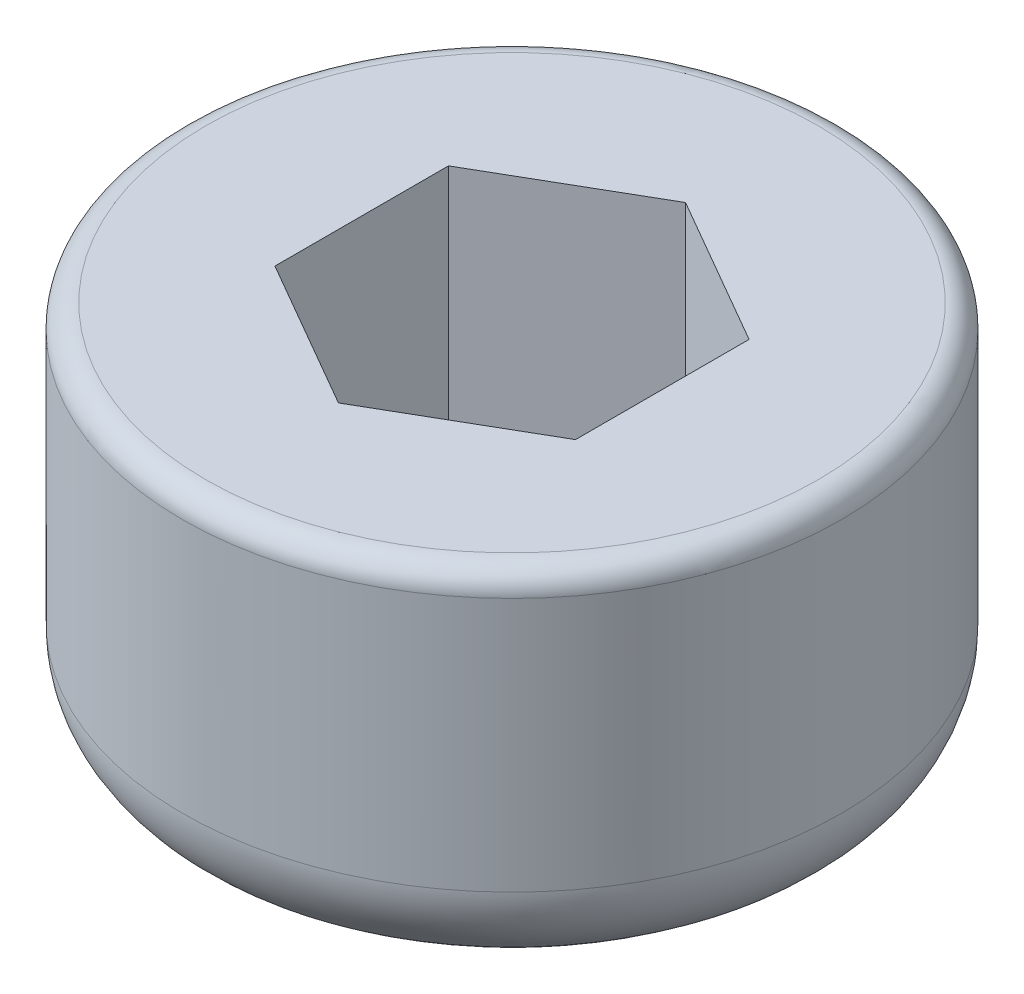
from build123d import *

# Parameters (mm, degrees)
CORTAR_EXTRUIR1_DEPTH = 26.731789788
REDONDEO1_R           = 1


with BuildPart() as part:
    # Croquis1 → Revoluci_n1 (revolve)
    with BuildSketch(Plane.XY):
        with BuildLine():
            Line((0, 0), (10.25, 0))
            ThreePointArc((10.25, 0), (13.078427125, 1.171572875), (14.25, 4))
            Line((14.25, 4), (14.25, 16))
            Line((14.25, 16), (0, 16))
            Line((0, 16), (0, 0))
        make_face()
    revolve(axis=Axis((0, 0, 0), (0, 1, 0)))

    # Croquis2 → Cortar-Extruir1 (cut, through all)
    with BuildSketch(Plane(origin=(0, 16, 0), x_dir=(1, 0, 0), z_dir=(0, 1, 0))):
        Polygon((0, 7.505553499), (-6.5, 3.75277675), (-6.5, -3.75277675), (0, -7.505553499), (6.5, -3.75277675), (6.5, 3.75277675), align=None)
    extrude(amount=-CORTAR_EXTRUIR1_DEPTH, mode=Mode.SUBTRACT)

    # Redondeo1
    redondeo1_edges = [part.edges().sort_by_distance(p)[0] for p in [
        (-14.25, 16, 0),
    ]]
    fillet(redondeo1_edges, radius=REDONDEO1_R)


solid = part.part
